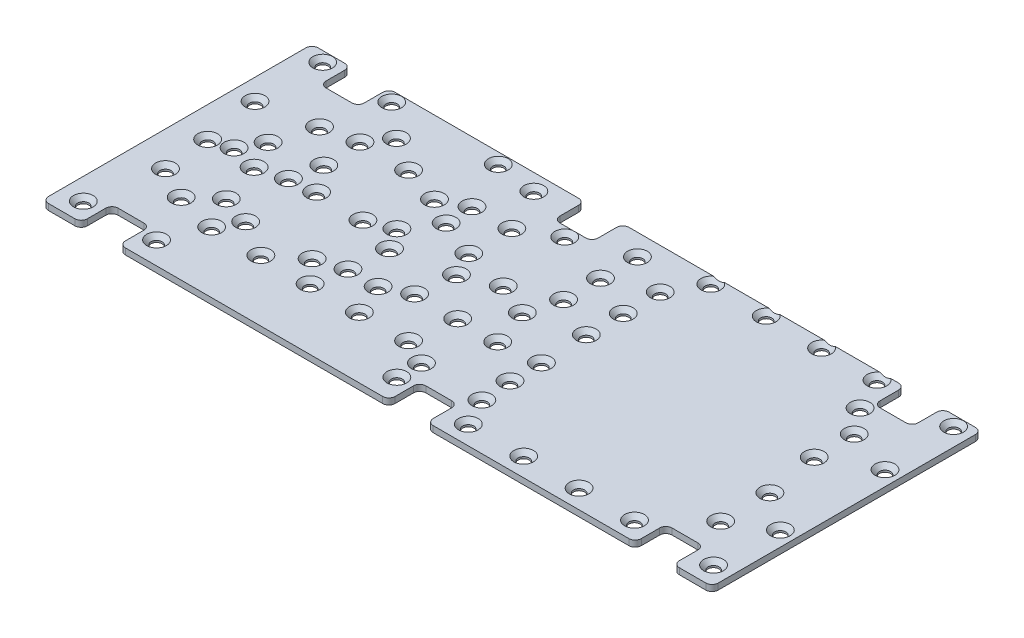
from build123d import *

# Parameters (mm, degrees)
EXTRUDE_1_DEPTH                = 1
HOLE_WIZARD_M1_6_2_D           = 1.8
HOLE_WIZARD_M1_6_2_DEPTH       = 4.25
HOLE_WIZARD_M1_6_2_CSINK_D     = 3.2
HOLE_WIZARD_M1_6_2_CSINK_ANGLE = 90
HOLE_WIZARD_M1_6_2_TIP         = 0.540774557


with BuildPart() as part:
    # Sketch 1 → Extrude 1 (new body)
    with BuildSketch(Plane(origin=(0, 0, 0), x_dir=(1, 0, 0), z_dir=(0, 1, 0))):
        with BuildLine():
            Line((14.099999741, 0.6), (55.9, 0.6))
            ThreePointArc((55.9, 0.6), (56.607106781, 0.892893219), (56.9, 1.6))
            Line((56.9, 1.6), (56.9, 4.599993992))
            ThreePointArc((56.9, 4.599993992), (57.192893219, 5.307100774), (57.9, 5.599993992))
            Line((57.9, 5.599993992), (62.099999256, 5.599993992))
            ThreePointArc((62.099999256, 5.599993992), (62.80710598, 5.307100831), (63.099999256, 4.599994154))
            Line((63.099999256, 4.599994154), (63.099999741, 1.599999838))
            ThreePointArc((63.099999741, 1.599999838), (63.392893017, 0.892893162), (64.099999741, 0.6))
            Line((64.099999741, 0.6), (95.9, 0.6))
            ThreePointArc((95.9, 0.6), (96.607106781, 0.892893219), (96.9, 1.6))
            Line((96.9, 1.6), (96.9, 4.599993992))
            ThreePointArc((96.9, 4.599993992), (97.192893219, 5.307100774), (97.9, 5.599993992))
            Line((97.9, 5.599993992), (102.099999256, 5.599993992))
            ThreePointArc((102.099999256, 5.599993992), (102.80710598, 5.307100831), (103.099999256, 4.599994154))
            Line((103.099999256, 4.599994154), (103.099999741, 1.599999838))
            ThreePointArc((103.099999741, 1.599999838), (103.392893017, 0.892893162), (104.099999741, 0.6))
            Line((104.099999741, 0.6), (108.4, 0.6))
            ThreePointArc((108.4, 0.6), (109.107106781, 0.892893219), (109.4, 1.6))
            Line((109.4, 1.6), (109.4, 43.4))
            ThreePointArc((109.4, 43.4), (109.107106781, 44.107106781), (108.4, 44.4))
            Line((108.4, 44.4), (104.099999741, 44.4))
            ThreePointArc((104.099999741, 44.4), (103.392893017, 44.107106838), (103.099999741, 43.400000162))
            Line((103.099999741, 43.400000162), (103.099999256, 40.400005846))
            ThreePointArc((103.099999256, 40.400005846), (102.80710598, 39.692899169), (102.099999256, 39.400006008))
            Line((102.099999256, 39.400006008), (97.9, 39.400006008))
            ThreePointArc((97.9, 39.400006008), (97.192893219, 39.692899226), (96.9, 40.400006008))
            Line((96.9, 40.400006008), (96.9, 43.4))
            ThreePointArc((96.9, 43.4), (96.607106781, 44.107106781), (95.9, 44.4))
            Line((95.9, 44.4), (52.099999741, 44.4))
            ThreePointArc((52.099999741, 44.4), (51.392893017, 44.107106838), (51.099999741, 43.400000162))
            Line((51.099999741, 43.400000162), (51.099999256, 40.400005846))
            ThreePointArc((51.099999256, 40.400005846), (50.80710598, 39.692899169), (50.099999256, 39.400006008))
            Line((50.099999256, 39.400006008), (45.9, 39.400006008))
            ThreePointArc((45.9, 39.400006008), (45.192893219, 39.692899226), (44.9, 40.400006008))
            Line((44.9, 40.400006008), (44.9, 43.4))
            ThreePointArc((44.9, 43.4), (44.607106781, 44.107106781), (43.9, 44.4))
            Line((43.9, 44.4), (14.099999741, 44.4))
            ThreePointArc((14.099999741, 44.4), (13.392893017, 44.107106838), (13.099999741, 43.400000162))
            Line((13.099999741, 43.400000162), (13.099999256, 40.400005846))
            ThreePointArc((13.099999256, 40.400005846), (12.80710598, 39.692899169), (12.099999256, 39.400006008))
            Line((12.099999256, 39.400006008), (7.9, 39.400006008))
            ThreePointArc((7.9, 39.400006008), (7.192893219, 39.692899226), (6.9, 40.400006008))
            Line((6.9, 40.400006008), (6.9, 43.4))
            ThreePointArc((6.9, 43.4), (6.607106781, 44.107106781), (5.9, 44.4))
            Line((5.9, 44.4), (1.6, 44.4))
            ThreePointArc((1.6, 44.4), (0.892893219, 44.107106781), (0.6, 43.4))
            Line((0.6, 43.4), (0.6, 1.6))
            ThreePointArc((0.6, 1.6), (0.892893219, 0.892893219), (1.6, 0.6))
            Line((1.6, 0.6), (5.9, 0.6))
            ThreePointArc((5.9, 0.6), (6.607106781, 0.892893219), (6.9, 1.6))
            Line((6.9, 1.6), (6.9, 4.599993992))
            ThreePointArc((6.9, 4.599993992), (7.192893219, 5.307100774), (7.9, 5.599993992))
            Line((7.9, 5.599993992), (12.099999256, 5.599993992))
            ThreePointArc((12.099999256, 5.599993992), (12.80710598, 5.307100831), (13.099999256, 4.599994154))
            Line((13.099999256, 4.599994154), (13.099999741, 1.599999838))
            ThreePointArc((13.099999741, 1.599999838), (13.392893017, 0.892893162), (14.099999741, 0.6))
        make_face()
    extrude(amount=EXTRUDE_1_DEPTH)

    # Sketch 3 → Hole Wizard M1.6 _1 (revolve, cut)
    with BuildSketch(Plane(origin=(4.1, 1, -3.75), x_dir=(0, 0, 1), z_dir=(1, 0, 0))):
        Polygon((0, 0), (0, 4.790774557), (0.9, 4.25), (0.9, 0.7), (1.6, 0), align=None)
    hole_wizard_m1_6_1 = revolve(axis=Axis((4.1, 7.35, -3.75), (0, -1, 0)), mode=Mode.SUBTRACT)

    # Pattern Sketch 1: Hole Wizard M1.6 _1 at 70 more places
    with Locations((-0.1, 0, -39), (-0.1, 0, -28), (1.4, 0, -18.8), (4.75, 0, -19.75), (6.725, 0, -23.3), (9.1, 0, -18.65), (13.475, 0, -19.85), (14.475, 0, -24.6), (8.725, 0, -29.65), (14.15, 0, -30.8), (16.6, 0, -34.275), (11.1, 0, -39), (28.525, 0, -38.9), (22.05, 0, -30.8), (28.25, 0, -28.8), (29.35, 0, -21.6), (25.375, 0, -20.05), (31.55, 0, -18.2), (2.1, 0, -11.25), (7.4, 0, -8.5), (11.275, 0, -11.95), (16.075, 0, -10.3), (14.05, 0, -6.8), (11.4, 0, -0.50377), (22.05, 0, -6.8), (26.675, 0, -10.5), (30.05, 0, -6.8), (31.05, 0, -11.95), (35.95, 0, -11.95), (38.05, 0, -6.8), (32.55, 0, -26.4), (32.35, 0, -30.8), (38.65, 0, -30.975), (35.2, 0, -38), (40.65, 0, -19.975), (38.65, 0, -23.975), (39.95, 0, -13.875), (44.15, 0, -34.075), (46.05, 0, -22.175), (46.95, 0, -13.875), (46.05, 0, -6.8), (50.240001, 0, -0.7), (50.240001, 0, -4.7), (53.45, 0, -13.875), (51.35, 0, -19.975), (52.85, 0, -25.175), (52.85, 0, -31.175), (52.85, 0, -37.175), (59.65, 0, -34.075), (62.65, 0, -39.3), (59.65, 0, -28.075), (59.65, 0, -22.075), (59.95, 0, -14.475), (59.95, 0, -9.375), (60.35, 0, -4.4), (62.65, 0, 0.1), (71.65, 0, 0.1), (80.65, 0, 0.1), (89.65, 0, 0.1), (96.8, 0, -6.75), (96.8, 0, -14.75), (102.9, 0, -10.35), (102.4, 0, 0), (95.4, 0, -23.35), (102.9, 0, -27.35), (95.4, 0, -29.85), (92.2, 0, -34.000006), (102.4, 0, -39), (89.65, 0, -39.3), (80.65, 0, -39.3)):
        add(hole_wizard_m1_6_1, mode=Mode.SUBTRACT)

    # Hole Wizard M1.6 _2
    with Locations(Plane(origin=(0, 1, 0), x_dir=(1, 0, 0), z_dir=(0, 1, 0))):
        with Locations((75.75, 43.05), (21.775, 23.98)):
            CounterSinkHole(HOLE_WIZARD_M1_6_2_D / 2, HOLE_WIZARD_M1_6_2_CSINK_D / 2, depth=HOLE_WIZARD_M1_6_2_DEPTH, counter_sink_angle=HOLE_WIZARD_M1_6_2_CSINK_ANGLE)
            with Locations((0, 0, -(HOLE_WIZARD_M1_6_2_DEPTH + HOLE_WIZARD_M1_6_2_TIP / 2))):  # 118° drill point
                Cone(0, HOLE_WIZARD_M1_6_2_D / 2, HOLE_WIZARD_M1_6_2_TIP, mode=Mode.SUBTRACT)


solid = part.part
